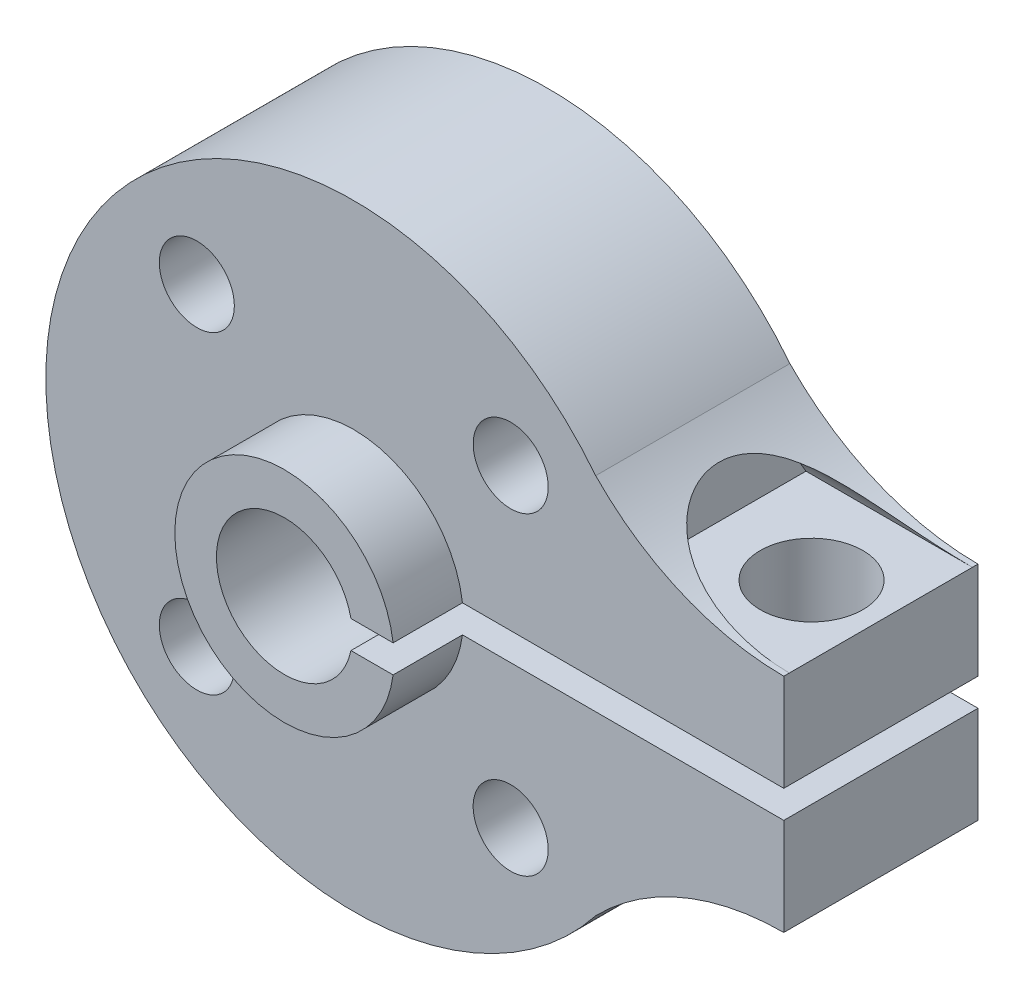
from build123d import *

# Parameters (mm, degrees)
EXTRUDE1_DEPTH            = 7
F_6_32_TAPPED_HOLE3_D     = 2.7051
EXTRUDE3_DEPTH            = 2.5
SKETCH9_R                 = 2.45
CUT_EXTRUDE3_DEPTH        = 22.300469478
SKETCH14_R                = 1.85
CUT_EXTRUDE6_DEPTH        = 21.586646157
F_6_32_TAPPED_HOLE5_D     = 2.7051
F_6_32_TAPPED_HOLE5_DEPTH = 50.8
F_6_32_TAPPED_HOLE5_TIP   = 0.81269403
CUT_EXTRUDE26_DEPTH       = 6


with BuildPart() as part:
    # Sketch1 → Extrude1 (new body)
    with BuildSketch(Plane.XY):
        with BuildLine():
            Line((0, 0), (0, 0.5))
            Line((0, 0.5), (15.5, 0.5))
            Line((15.5, 0.5), (15.5, 4))
            ThreePointArc((15.5, 4), (11.819050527, 4.746581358), (8.719864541, 6.868330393))
            ThreePointArc((8.719864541, 6.868330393), (-11.1, 0), (8.719864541, -6.868330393))
            ThreePointArc((8.719864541, -6.868330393), (11.819050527, -4.746581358), (15.5, -4))
            Line((15.5, -4), (15.5, -0.5))
            Line((15.5, -0.5), (0, -0.5))
            Line((0, -0.5), (0, 0))
        make_face()
    extrude(amount=-EXTRUDE1_DEPTH)

    # 6-32 Tapped Hole3 (through all)
    with Locations(Plane(origin=(-5.656516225, 5.657192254, 0), x_dir=(1, 0, 0), z_dir=(0, 0, 1))):
        with Locations((0, 0), (11.313708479, -0.000676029), (11.31303245, -11.314384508), (-0.000676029, -11.313708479)):
            Hole(F_6_32_TAPPED_HOLE3_D / 2)

    # Sketch8 → Extrude3 (add)
    with BuildSketch(Plane.XY):
        with BuildLine():
            Line((3.91822664, -0.5), (0, -0.5))
            Line((0, -0.5), (0, 0.5))
            Line((0, 0.5), (3.91822664, 0.5))
            ThreePointArc((3.91822664, 0.5), (-3.95, 0), (3.91822664, -0.5))
        make_face()
    extrude(amount=EXTRUDE3_DEPTH)

    # Sketch9 → Cut-Extrude3 (cut, through all)
    with BuildSketch(Plane.XY.offset(2.5)):
        Circle(SKETCH9_R)
    extrude(amount=-CUT_EXTRUDE3_DEPTH, mode=Mode.SUBTRACT)

    # Sketch14 → Cut-Extrude6 (cut, through all)
    with BuildSketch(Plane.XZ.offset(-0.5)):
        with Locations(Location((13, -3.5, 0), (0, 0, 270))):
            Circle(SKETCH14_R)
    extrude(amount=-CUT_EXTRUDE6_DEPTH, mode=Mode.SUBTRACT)

    # 6-32 Tapped Hole5
    with Locations(Plane(origin=(0, -0.5, 0), x_dir=(-1, 0, 0), z_dir=(0, 1, 0))):
        with Locations((-13, -3.5)):
            Hole(F_6_32_TAPPED_HOLE5_D / 2, depth=F_6_32_TAPPED_HOLE5_DEPTH)
            with Locations((0, 0, -(F_6_32_TAPPED_HOLE5_DEPTH + F_6_32_TAPPED_HOLE5_TIP / 2))):  # 118° drill point
                Cone(0, F_6_32_TAPPED_HOLE5_D / 2, F_6_32_TAPPED_HOLE5_TIP, mode=Mode.SUBTRACT)

    # Sketch24 → Cut-Extrude26 (cut)
    with BuildSketch(Plane(origin=(15.5, 0, 0), x_dir=(0, 0, -1), z_dir=(1, 0, 0))):
        with BuildLine():
            Line((0.2, 4), (6.8, 4))
            ThreePointArc((6.8, 4), (3.5, 6.016591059), (0.2, 4))
        make_face()
    extrude(amount=-CUT_EXTRUDE26_DEPTH, mode=Mode.SUBTRACT)


solid = part.part
